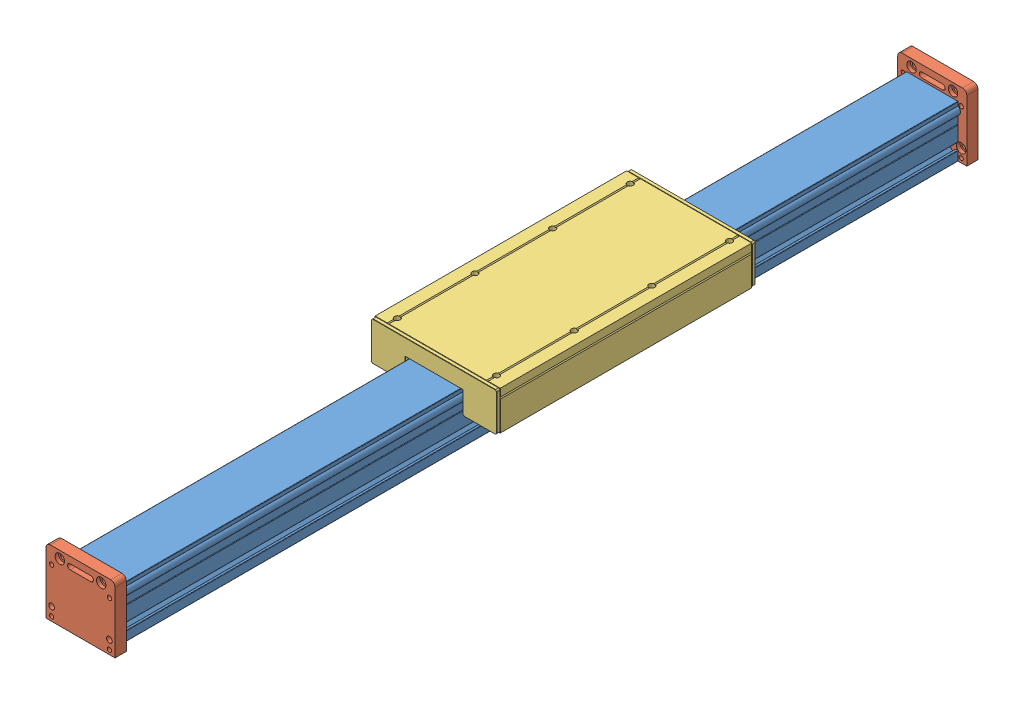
SolidWorks assembly MO_060_300_1000.SLDASM, configuration Standard (file format 3800). Lengths in mm.
Overall size (145 80 1000).
4 component instances, 3 part files, 11 mates.
Components (placement in the parent):
- Profil_MZ060-1: Profil_MZ060.SLDPRT [l=974] at (0 30 0) x (-1 0 0) z (0 0 1) size (65.5 60 974)
- Adapterplatte_MZS060-1: Adapterplatte_MZS060.SLDPRT [Standard] at (0 0 974) size (80 76 13)
- Adapterplatte_MZS060-2: Adapterplatte_MZS060.SLDPRT [Standard] x (-1 0 0) z (0 0 -1) size (80 76 13)
- Schlitten_MO_060_300-1: Schlitten_MO_060_300.SLDPRT [Standard] at (0 0 427.3927) size (145 45 300)
Mates (geometry in assembly coordinates):
- Deckungsgleich1: coincident aligned: plane of Profil_MZ060-1 through (0 30 0) normal (0 0 1)
- Deckungsgleich2: coincident anti-aligned: unknown of Profil_MZ060-1
- Deckungsgleich3: coincident anti-aligned: unknown of Profil_MZ060-1
- Deckungsgleich4: coincident anti-aligned: plane of Adapterplatte_MZS060-2 through (40 0 0) normal (0 0 1); plane of Profil_MZ060-1 through (-30 60 0) normal (0 0 -1)
- Deckungsgleich5: coincident aligned: plane of Profil_MZ060-1 through (-30 0 974) normal (0 -1 0); plane of Adapterplatte_MZS060-2 through (40 0 -13) normal (0 -1 0)
- Breite1: width: plane of Adapterplatte_MZS060-2 through (-40 0 -13) normal (-1 0 0); plane of Adapterplatte_MZS060-2 through (40 0 -13) normal (1 0 0); plane of Profil_MZ060-1 through (-30 60 974) normal (-1 0 0); plane of Profil_MZ060-1 through (30 0 974) normal (1 0 0)
- Deckungsgleich6: coincident anti-aligned: plane of Profil_MZ060-1 through (-30 60 974) normal (0 0 1); plane of Adapterplatte_MZS060-1 through (-40 0 974) normal (0 0 -1)
- Deckungsgleich7: coincident aligned: plane of Profil_MZ060-1 through (-30 0 974) normal (0 -1 0); plane of Adapterplatte_MZS060-1 through (-40 0 987) normal (0 -1 0)
- Breite2: width: plane of Adapterplatte_MZS060-1 through (-40 0 987) normal (-1 0 0); plane of Adapterplatte_MZS060-1 through (40 0 987) normal (1 0 0); plane of Profil_MZ060-1 through (30 0 974) normal (1 0 0); plane of Profil_MZ060-1 through (-30 60 974) normal (-1 0 0)
- Abstand1: distance = 80 mm anti-aligned: plane of Profil_MZ060-1 through (-30 0 974) normal (0 -1 0); plane of Schlitten_MO_060_300-1 through (72.5 80 573.3927) normal (0 1 0)
- Breite3: width: plane of Schlitten_MO_060_300-1 through (-72.5 80 573.3927) normal (-1 0 0); plane of Schlitten_MO_060_300-1 through (72.5 80 573.3927) normal (1 0 0); plane of Profil_MZ060-1 through (-30 60 974) normal (-1 0 0); plane of Profil_MZ060-1 through (30 0 974) normal (1 0 0)
